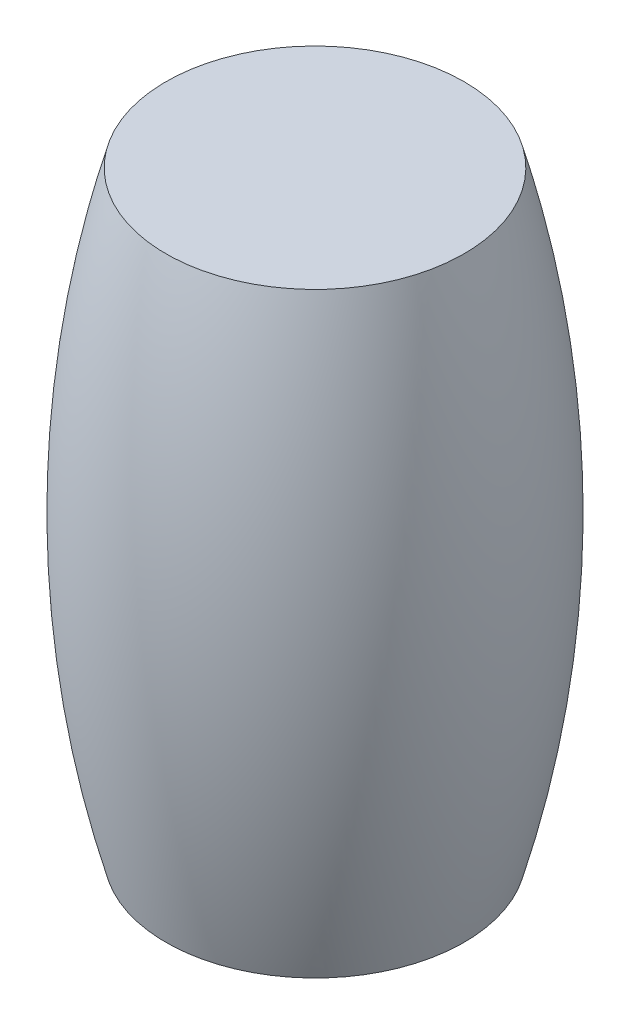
from build123d import *


with BuildPart() as part:
    # Sketch 1 → Revolve 1 (revolve)
    with BuildSketch(Plane.XY, mode=Mode.PRIVATE) as revolve_1_sk:
        with BuildLine():
            Line((0, 0), (20, 0))
            ThreePointArc((20, 0), (25.431677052, 40), (20, 80))
            Line((20, 80), (0, 80))
            Line((0, 80), (0, 0))
        make_face()
    revolve(revolve_1_sk.sketch.rotate(Axis((0, 0, 0), (0, 1, 0)), 90), axis=Axis((0, 0, 0), (0, 1, 0)))


solid = part.part
